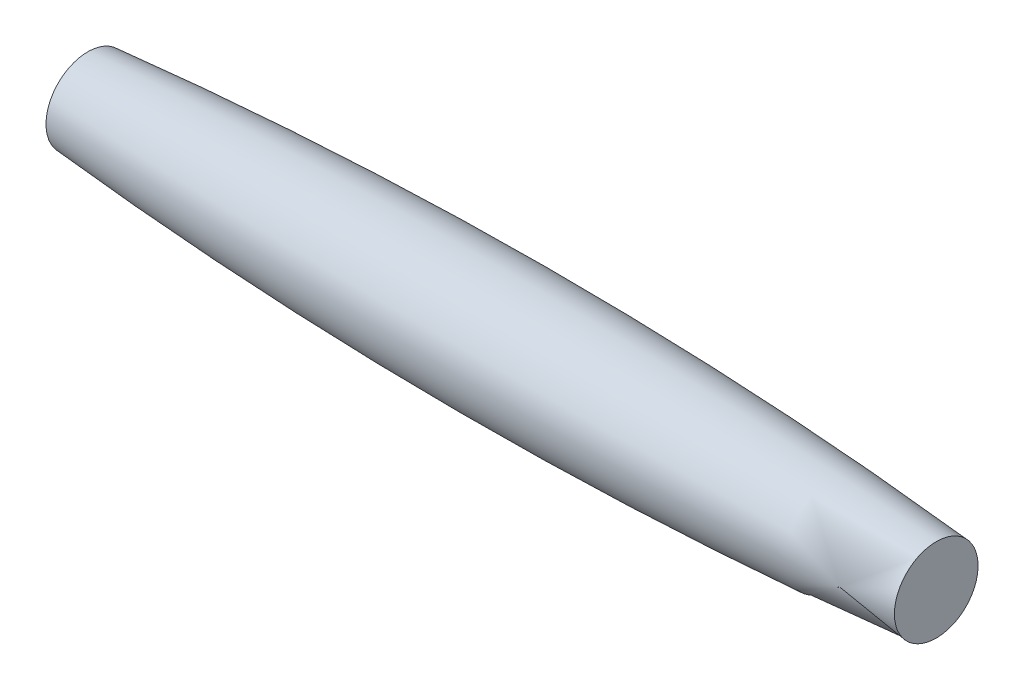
ISO-10303-21;
HEADER;
FILE_DESCRIPTION(('STEP AP214'),'2;1');
FILE_NAME('part.step','',(''),(''),'','','');
FILE_SCHEMA(('AUTOMOTIVE_DESIGN { 1 0 10303 214 1 1 1 1 }'));
ENDSEC;
DATA;
#1=APPLICATION_CONTEXT('core data for automotive mechanical design processes');
#2=APPLICATION_PROTOCOL_DEFINITION('international standard','automotive_design',2000,#1);
#3=PRODUCT_CONTEXT('',#1,'mechanical');
#4=PRODUCT('Part','Part','',(#3));
#5=PRODUCT_RELATED_PRODUCT_CATEGORY('part','',(#4));
#6=PRODUCT_DEFINITION_FORMATION('','',#4);
#7=PRODUCT_DEFINITION_CONTEXT('part definition',#1,'design');
#8=PRODUCT_DEFINITION('design','',#6,#7);
#9=PRODUCT_DEFINITION_SHAPE('','',#8);
#10=(LENGTH_UNIT() NAMED_UNIT(*) SI_UNIT(.MILLI.,.METRE.));
#11=(NAMED_UNIT(*) PLANE_ANGLE_UNIT() SI_UNIT($,.RADIAN.));
#12=(NAMED_UNIT(*) SI_UNIT($,.STERADIAN.) SOLID_ANGLE_UNIT());
#13=UNCERTAINTY_MEASURE_WITH_UNIT(LENGTH_MEASURE(1.E-05),#10,'distance_accuracy_value','');
#14=(GEOMETRIC_REPRESENTATION_CONTEXT(3) GLOBAL_UNCERTAINTY_ASSIGNED_CONTEXT((#13)) GLOBAL_UNIT_ASSIGNED_CONTEXT((#10,
#11,#12)) REPRESENTATION_CONTEXT('',''));
#15=CARTESIAN_POINT('',(0.,0.,0.));
#16=DIRECTION('',(0.,0.,1.));
#17=DIRECTION('',(1.,0.,0.));
#18=AXIS2_PLACEMENT_3D('',#15,#16,#17);
#19=CARTESIAN_POINT('',(-1420.,0.,0.));
#20=DIRECTION('',(1.,0.,0.));
#21=DIRECTION('',(0.,0.,-1.));
#22=AXIS2_PLACEMENT_3D('',#19,#20,#21);
#23=PLANE('',#22);
#24=CARTESIAN_POINT('',(-1420.,0.,0.));
#25=DIRECTION('',(-1.,0.,0.));
#26=DIRECTION('',(0.,0.,1.));
#27=AXIS2_PLACEMENT_3D('',#24,#25,#26);
#28=CIRCLE('',#27,139.99999999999);
#29=CARTESIAN_POINT('',(-1420.,0.,139.99999999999));
#30=VERTEX_POINT('',#29);
#31=EDGE_CURVE('E10',#30,#30,#28,.T.);
#32=ORIENTED_EDGE('',*,*,#31,.T.);
#33=EDGE_LOOP('',(#32));
#34=FACE_BOUND('',#33,.T.);
#35=ADVANCED_FACE('F31',(#34),#23,.F.);
#36=CARTESIAN_POINT('',(4.9938036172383E-13,0.,0.));
#37=DIRECTION('',(-1.,0.,0.));
#38=DIRECTION('',(0.,0.,1.));
#39=AXIS2_PLACEMENT_3D('',#36,#37,#38);
#40=DEGENERATE_TOROIDAL_SURFACE('',#39,16633.3333333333,16833.3333333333,.F.);
#41=ORIENTED_EDGE('',*,*,#31,.F.);
#42=EDGE_LOOP('',(#41));
#43=FACE_BOUND('',#42,.T.);
#44=CARTESIAN_POINT('',(1420.,0.,0.));
#45=DIRECTION('',(-1.,0.,0.));
#46=DIRECTION('',(0.,0.,1.));
#47=AXIS2_PLACEMENT_3D('',#44,#45,#46);
#48=CIRCLE('',#47,139.99999999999);
#49=CARTESIAN_POINT('',(1420.,0.,139.99999999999));
#50=VERTEX_POINT('',#49);
#51=EDGE_CURVE('E37',#50,#50,#48,.T.);
#52=ORIENTED_EDGE('',*,*,#51,.T.);
#53=EDGE_LOOP('',(#52));
#54=FACE_BOUND('',#53,.T.);
#55=ADVANCED_FACE('F43',(#43,#54),#40,.F.);
#56=CARTESIAN_POINT('',(1420.,0.,0.));
#57=DIRECTION('',(-1.,0.,0.));
#58=DIRECTION('',(0.,0.,1.));
#59=AXIS2_PLACEMENT_3D('',#56,#57,#58);
#60=PLANE('',#59);
#61=ORIENTED_EDGE('',*,*,#51,.F.);
#62=EDGE_LOOP('',(#61));
#63=FACE_BOUND('',#62,.T.);
#64=ADVANCED_FACE('F45',(#63),#60,.F.);
#65=CLOSED_SHELL('',(#35,#55,#64));
#66=MANIFOLD_SOLID_BREP('B2',#65);
#67=ADVANCED_BREP_SHAPE_REPRESENTATION('',(#18,#66),#14);
#68=SHAPE_DEFINITION_REPRESENTATION(#9,#67);
ENDSEC;
END-ISO-10303-21;
